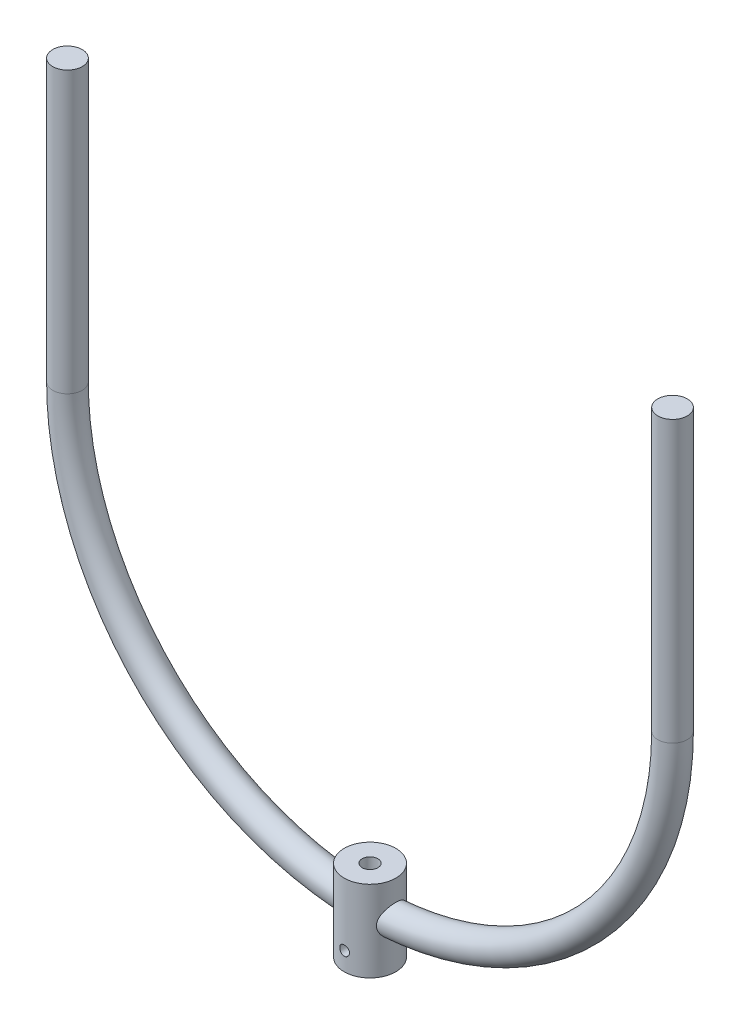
ISO-10303-21;
HEADER;
FILE_DESCRIPTION(('STEP AP214'),'2;1');
FILE_NAME('part.step','',(''),(''),'','','');
FILE_SCHEMA(('AUTOMOTIVE_DESIGN { 1 0 10303 214 1 1 1 1 }'));
ENDSEC;
DATA;
#1=APPLICATION_CONTEXT('core data for automotive mechanical design processes');
#2=APPLICATION_PROTOCOL_DEFINITION('international standard','automotive_design',2000,#1);
#3=PRODUCT_CONTEXT('',#1,'mechanical');
#4=PRODUCT('Part','Part','',(#3));
#5=PRODUCT_RELATED_PRODUCT_CATEGORY('part','',(#4));
#6=PRODUCT_DEFINITION_FORMATION('','',#4);
#7=PRODUCT_DEFINITION_CONTEXT('part definition',#1,'design');
#8=PRODUCT_DEFINITION('design','',#6,#7);
#9=PRODUCT_DEFINITION_SHAPE('','',#8);
#10=(LENGTH_UNIT() NAMED_UNIT(*) SI_UNIT(.MILLI.,.METRE.));
#11=(NAMED_UNIT(*) PLANE_ANGLE_UNIT() SI_UNIT($,.RADIAN.));
#12=(NAMED_UNIT(*) SI_UNIT($,.STERADIAN.) SOLID_ANGLE_UNIT());
#13=UNCERTAINTY_MEASURE_WITH_UNIT(LENGTH_MEASURE(1.E-05),#10,'distance_accuracy_value','');
#14=(GEOMETRIC_REPRESENTATION_CONTEXT(3) GLOBAL_UNCERTAINTY_ASSIGNED_CONTEXT((#13)) GLOBAL_UNIT_ASSIGNED_CONTEXT((#10,
#11,#12)) REPRESENTATION_CONTEXT('',''));
#15=CARTESIAN_POINT('',(0.,0.,0.));
#16=DIRECTION('',(0.,0.,1.));
#17=DIRECTION('',(1.,0.,0.));
#18=AXIS2_PLACEMENT_3D('',#15,#16,#17);
#19=CARTESIAN_POINT('',(0.,-228.6,0.));
#20=DIRECTION('',(0.,1.,0.));
#21=DIRECTION('',(0.,0.,1.));
#22=AXIS2_PLACEMENT_3D('',#19,#20,#21);
#23=CYLINDRICAL_SURFACE('',#22,6.74623999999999);
#24=CARTESIAN_POINT('',(0.,-228.6,0.));
#25=DIRECTION('',(0.,1.,0.));
#26=DIRECTION('',(0.,0.,1.));
#27=AXIS2_PLACEMENT_3D('',#24,#25,#26);
#28=CIRCLE('',#27,6.74623999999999);
#29=CARTESIAN_POINT('',(0.,-228.6,6.74623999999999));
#30=VERTEX_POINT('',#29);
#31=EDGE_CURVE('E98',#30,#30,#28,.T.);
#32=ORIENTED_EDGE('',*,*,#31,.T.);
#33=EDGE_LOOP('',(#32));
#34=FACE_BOUND('',#33,.T.);
#35=CARTESIAN_POINT('',(0.,-254.254,0.));
#36=DIRECTION('',(0.,-1.,0.));
#37=DIRECTION('',(0.,0.,-1.));
#38=AXIS2_PLACEMENT_3D('',#35,#36,#37);
#39=CIRCLE('',#38,6.74623999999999);
#40=CARTESIAN_POINT('',(0.,-254.254,-6.74623999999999));
#41=VERTEX_POINT('',#40);
#42=EDGE_CURVE('E35',#41,#41,#39,.F.);
#43=ORIENTED_EDGE('',*,*,#42,.F.);
#44=EDGE_LOOP('',(#43));
#45=FACE_BOUND('',#44,.T.);
#46=ADVANCED_FACE('F30',(#34,#45),#23,.F.);
#47=CARTESIAN_POINT('',(0.,0.,0.));
#48=DIRECTION('',(0.,0.,-1.));
#49=DIRECTION('',(-1.,0.,0.));
#50=AXIS2_PLACEMENT_3D('',#47,#48,#49);
#51=TOROIDAL_SURFACE('',#50,260.35,12.7);
#52=CARTESIAN_POINT('',(-260.35,0.,0.));
#53=DIRECTION('',(0.,-1.,0.));
#54=DIRECTION('',(1.,0.,0.));
#55=AXIS2_PLACEMENT_3D('',#52,#53,#54);
#56=CIRCLE('',#55,12.7);
#57=CARTESIAN_POINT('',(-260.35,0.,-12.7));
#58=VERTEX_POINT('',#57);
#59=EDGE_CURVE('E39',#58,#58,#56,.F.);
#60=ORIENTED_EDGE('',*,*,#59,.F.);
#61=EDGE_LOOP('',(#60));
#62=FACE_BOUND('',#61,.T.);
#63=CARTESIAN_POINT('',(-20.4249747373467,-268.768442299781,-8.76190801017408));
#64=CARTESIAN_POINT('',(-20.5326126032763,-269.000091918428,-8.5109895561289));
#65=CARTESIAN_POINT('',(-20.6390318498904,-269.221623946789,-8.25013660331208));
#66=CARTESIAN_POINT('',(-20.8469298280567,-269.643399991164,-7.70973443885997));
#67=CARTESIAN_POINT('',(-20.9484064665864,-269.843635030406,-7.43017742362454));
#68=CARTESIAN_POINT('',(-21.1441788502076,-270.221915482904,-6.85326619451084));
#69=CARTESIAN_POINT('',(-21.2384617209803,-270.399921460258,-6.5558816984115));
#70=CARTESIAN_POINT('',(-21.4173933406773,-270.732082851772,-5.94533940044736));
#71=CARTESIAN_POINT('',(-21.5020432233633,-270.886241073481,-5.63218346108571));
#72=CARTESIAN_POINT('',(-21.6599324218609,-271.169981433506,-4.9907332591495));
#73=CARTESIAN_POINT('',(-21.7331301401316,-271.299474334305,-4.66238917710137));
#74=CARTESIAN_POINT('',(-21.8658825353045,-271.531971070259,-3.99374123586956));
#75=CARTESIAN_POINT('',(-21.9254367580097,-271.634974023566,-3.65343697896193));
#76=CARTESIAN_POINT('',(-22.0292663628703,-271.813287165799,-2.96370543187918));
#77=CARTESIAN_POINT('',(-22.0735562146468,-271.888623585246,-2.61428712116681));
#78=CARTESIAN_POINT('',(-22.1457131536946,-272.01083871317,-1.90884415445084));
#79=CARTESIAN_POINT('',(-22.1735815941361,-272.057719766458,-1.55282004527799));
#80=CARTESIAN_POINT('',(-22.2107609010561,-272.120162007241,-0.862396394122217));
#81=CARTESIAN_POINT('',(-22.2212387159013,-272.137693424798,-0.528236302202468));
#82=CARTESIAN_POINT('',(-22.2270708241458,-272.147458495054,0.140577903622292));
#83=CARTESIAN_POINT('',(-22.2224258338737,-272.139693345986,0.475231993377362));
#84=CARTESIAN_POINT('',(-22.1981284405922,-272.098955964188,1.14243853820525));
#85=CARTESIAN_POINT('',(-22.178476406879,-272.065984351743,1.47499104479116));
#86=CARTESIAN_POINT('',(-22.1246490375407,-271.975203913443,2.13549034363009));
#87=CARTESIAN_POINT('',(-22.0904737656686,-271.917395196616,2.46343715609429));
#88=CARTESIAN_POINT('',(-22.0099545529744,-271.780164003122,3.10027278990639));
#89=CARTESIAN_POINT('',(-21.9641110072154,-271.701626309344,3.40941658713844));
#90=CARTESIAN_POINT('',(-21.8607252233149,-271.522823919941,4.01932687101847));
#91=CARTESIAN_POINT('',(-21.8031833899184,-271.422559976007,4.32009364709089));
#92=CARTESIAN_POINT('',(-21.6776025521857,-271.201127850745,4.91157759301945));
#93=CARTESIAN_POINT('',(-21.609562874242,-271.079958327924,5.20229411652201));
#94=CARTESIAN_POINT('',(-21.4643649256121,-270.817608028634,5.77218736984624));
#95=CARTESIAN_POINT('',(-21.3872061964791,-270.676426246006,6.05136351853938));
#96=CARTESIAN_POINT('',(-21.2200681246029,-270.365248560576,6.61445700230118));
#97=CARTESIAN_POINT('',(-21.1295832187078,-270.193982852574,6.89752268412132));
#98=CARTESIAN_POINT('',(-20.9419562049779,-269.830870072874,7.44779259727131));
#99=CARTESIAN_POINT('',(-20.8448138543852,-269.639022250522,7.71499624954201));
#100=CARTESIAN_POINT('',(-20.6458727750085,-269.235585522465,8.23258736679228));
#101=CARTESIAN_POINT('',(-20.5440703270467,-269.02398070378,8.48296099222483));
#102=CARTESIAN_POINT('',(-20.3380812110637,-268.582094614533,8.96559727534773));
#103=CARTESIAN_POINT('',(-20.2338944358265,-268.351812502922,9.19785911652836));
#104=CARTESIAN_POINT('',(-20.0157582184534,-267.851194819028,9.66396691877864));
#105=CARTESIAN_POINT('',(-19.9018016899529,-267.579125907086,9.89595253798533));
#106=CARTESIAN_POINT('',(-19.6770009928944,-267.014817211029,10.3357275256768));
#107=CARTESIAN_POINT('',(-19.566157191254,-266.722575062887,10.5435140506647));
#108=CARTESIAN_POINT('',(-19.3510572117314,-266.119349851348,10.9332855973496));
#109=CARTESIAN_POINT('',(-19.2467966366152,-265.808379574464,11.115287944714));
#110=CARTESIAN_POINT('',(-19.0483387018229,-265.168989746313,11.4520581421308));
#111=CARTESIAN_POINT('',(-18.9541390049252,-264.840574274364,11.6068323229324));
#112=CARTESIAN_POINT('',(-18.7950254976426,-264.228359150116,11.8623805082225));
#113=CARTESIAN_POINT('',(-18.7278877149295,-263.947095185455,11.967861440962));
#114=CARTESIAN_POINT('',(-18.6047182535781,-263.37539981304,12.1584526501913));
#115=CARTESIAN_POINT('',(-18.5486845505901,-263.08497008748,12.2435666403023));
#116=CARTESIAN_POINT('',(-18.4494924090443,-262.496844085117,12.3925329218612));
#117=CARTESIAN_POINT('',(-18.4063215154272,-262.199155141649,12.4564057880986));
#118=CARTESIAN_POINT('',(-18.3341838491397,-261.59820557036,12.5623424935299));
#119=CARTESIAN_POINT('',(-18.3052171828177,-261.29494490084,12.6044061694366));
#120=CARTESIAN_POINT('',(-18.2623728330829,-260.684282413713,12.6664042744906));
#121=CARTESIAN_POINT('',(-18.2485356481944,-260.376871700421,12.6862793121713));
#122=CARTESIAN_POINT('',(-18.2364641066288,-259.761116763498,12.7036260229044));
#123=CARTESIAN_POINT('',(-18.2382297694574,-259.4527725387,12.7010976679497));
#124=CARTESIAN_POINT('',(-18.2571327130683,-258.837415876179,12.6739100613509));
#125=CARTESIAN_POINT('',(-18.2742766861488,-258.530404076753,12.6492411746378));
#126=CARTESIAN_POINT('',(-18.3231441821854,-257.920071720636,12.5783485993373));
#127=CARTESIAN_POINT('',(-18.3548678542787,-257.616751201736,12.5321246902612));
#128=CARTESIAN_POINT('',(-18.43042670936,-257.025216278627,12.4207230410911));
#129=CARTESIAN_POINT('',(-18.4738490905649,-256.736826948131,12.3561879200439));
#130=CARTESIAN_POINT('',(-18.5717808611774,-256.166704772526,12.2084981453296));
#131=CARTESIAN_POINT('',(-18.6262938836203,-255.884974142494,12.1253373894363));
#132=CARTESIAN_POINT('',(-18.7448284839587,-255.329411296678,11.9412725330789));
#133=CARTESIAN_POINT('',(-18.8088505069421,-255.055579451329,11.8403676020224));
#134=CARTESIAN_POINT('',(-18.9447427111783,-254.516830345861,11.6217017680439));
#135=CARTESIAN_POINT('',(-19.016613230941,-254.251913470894,11.5039401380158));
#136=CARTESIAN_POINT('',(-19.2650694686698,-253.390097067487,11.087029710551));
#137=CARTESIAN_POINT('',(-19.455349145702,-252.813556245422,10.7525765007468));
#138=CARTESIAN_POINT('',(-19.751268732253,-251.993455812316,10.1922957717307));
#139=CARTESIAN_POINT('',(-19.8517516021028,-251.727326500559,9.99556985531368));
#140=CARTESIAN_POINT('',(-20.054117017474,-251.210639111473,9.58309582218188));
#141=CARTESIAN_POINT('',(-20.155999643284,-250.960081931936,9.36734661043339));
#142=CARTESIAN_POINT('',(-20.3756312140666,-250.435963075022,8.88069535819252));
#143=CARTESIAN_POINT('',(-20.4932461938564,-250.165353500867,8.60654732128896));
#144=CARTESIAN_POINT('',(-20.7242356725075,-249.648476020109,8.03441685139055));
#145=CARTESIAN_POINT('',(-20.8376094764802,-249.402212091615,7.73643053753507));
#146=CARTESIAN_POINT('',(-21.056853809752,-248.936406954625,7.11807874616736));
#147=CARTESIAN_POINT('',(-21.162730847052,-248.71684244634,6.79773317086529));
#148=CARTESIAN_POINT('',(-21.3639959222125,-248.306655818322,6.13594420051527));
#149=CARTESIAN_POINT('',(-21.4593869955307,-248.11602531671,5.79450695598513));
#150=CARTESIAN_POINT('',(-21.6183245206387,-247.802612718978,5.16536904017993));
#151=CARTESIAN_POINT('',(-21.6843721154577,-247.673959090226,4.88121260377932));
#152=CARTESIAN_POINT('',(-21.8066308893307,-247.437829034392,4.30220493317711));
#153=CARTESIAN_POINT('',(-21.8628439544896,-247.330348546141,4.00735576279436));
#154=CARTESIAN_POINT('',(-21.9641347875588,-247.137917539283,3.40873717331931));
#155=CARTESIAN_POINT('',(-22.0092200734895,-247.052951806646,3.10497393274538));
#156=CARTESIAN_POINT('',(-22.0872186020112,-246.906614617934,2.49025583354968));
#157=CARTESIAN_POINT('',(-22.1201316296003,-246.845243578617,2.17930084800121));
#158=CARTESIAN_POINT('',(-22.1730532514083,-246.746821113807,1.5511514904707));
#159=CARTESIAN_POINT('',(-22.1930084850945,-246.709870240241,1.23393679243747));
#160=CARTESIAN_POINT('',(-22.2192663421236,-246.661288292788,0.597004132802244));
#161=CARTESIAN_POINT('',(-22.225568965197,-246.649657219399,0.277286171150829));
#162=CARTESIAN_POINT('',(-22.224350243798,-246.651908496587,-0.362034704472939));
#163=CARTESIAN_POINT('',(-22.2168287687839,-246.665791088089,-0.681637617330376));
#164=CARTESIAN_POINT('',(-22.1881655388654,-246.718839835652,-1.31810750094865));
#165=CARTESIAN_POINT('',(-22.1670242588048,-246.758005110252,-1.63497456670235));
#166=CARTESIAN_POINT('',(-22.1134792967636,-246.857650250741,-2.24315848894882));
#167=CARTESIAN_POINT('',(-22.0818923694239,-246.916587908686,-2.53480247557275));
#168=CARTESIAN_POINT('',(-22.0080107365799,-247.055242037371,-3.11169591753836));
#169=CARTESIAN_POINT('',(-21.965716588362,-247.134957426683,-3.39694570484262));
#170=CARTESIAN_POINT('',(-21.8713218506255,-247.314201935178,-3.95945021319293));
#171=CARTESIAN_POINT('',(-21.8192216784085,-247.413730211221,-4.23670527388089));
#172=CARTESIAN_POINT('',(-21.7062373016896,-247.631567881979,-4.78199311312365));
#173=CARTESIAN_POINT('',(-21.6453496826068,-247.749884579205,-5.0500222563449));
#174=CARTESIAN_POINT('',(-21.5114084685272,-248.013074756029,-5.59408812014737));
#175=CARTESIAN_POINT('',(-21.4378011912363,-248.159228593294,-5.86936866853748));
#176=CARTESIAN_POINT('',(-21.2833037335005,-248.470440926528,-6.407018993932));
#177=CARTESIAN_POINT('',(-21.2024104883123,-248.635507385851,-6.66938326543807));
#178=CARTESIAN_POINT('',(-21.0348884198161,-248.983238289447,-7.18027669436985));
#179=CARTESIAN_POINT('',(-20.9482589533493,-249.165904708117,-7.42880429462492));
#180=CARTESIAN_POINT('',(-20.7708300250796,-249.547662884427,-7.91134286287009));
#181=CARTESIAN_POINT('',(-20.6800301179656,-249.746756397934,-8.14535227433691));
#182=CARTESIAN_POINT('',(-20.4811362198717,-250.19336526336,-8.63446912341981));
#183=CARTESIAN_POINT('',(-20.3725964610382,-250.443535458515,-8.88697621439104));
#184=CARTESIAN_POINT('',(-20.1546197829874,-250.963062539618,-9.37082331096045));
#185=CARTESIAN_POINT('',(-20.0451830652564,-251.232415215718,-9.60216793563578));
#186=CARTESIAN_POINT('',(-19.827842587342,-251.789576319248,-10.0432978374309));
#187=CARTESIAN_POINT('',(-19.7199415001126,-252.077413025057,-10.2530487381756));
#188=CARTESIAN_POINT('',(-19.5086196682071,-252.670039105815,-10.6496422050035));
#189=CARTESIAN_POINT('',(-19.4051990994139,-252.974829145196,-10.8364838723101));
#190=CARTESIAN_POINT('',(-19.1961102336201,-253.630528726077,-11.2030668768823));
#191=CARTESIAN_POINT('',(-19.0911924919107,-253.983047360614,-11.380372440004));
#192=CARTESIAN_POINT('',(-18.8943303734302,-254.705507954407,-11.7043097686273));
#193=CARTESIAN_POINT('',(-18.8023878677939,-255.075452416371,-11.8509371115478));
#194=CARTESIAN_POINT('',(-18.6358734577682,-255.829660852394,-12.1110972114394));
#195=CARTESIAN_POINT('',(-18.5612622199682,-256.213890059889,-12.2247050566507));
#196=CARTESIAN_POINT('',(-18.4331861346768,-256.99438125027,-12.4169931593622));
#197=CARTESIAN_POINT('',(-18.3797114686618,-257.390637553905,-12.4956896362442));
#198=CARTESIAN_POINT('',(-18.308289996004,-258.08393298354,-12.5999969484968));
#199=CARTESIAN_POINT('',(-18.2846639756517,-258.379126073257,-12.634180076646));
#200=CARTESIAN_POINT('',(-18.251453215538,-258.971933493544,-12.682111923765));
#201=CARTESIAN_POINT('',(-18.2418656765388,-259.269547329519,-12.6958647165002));
#202=CARTESIAN_POINT('',(-18.2372235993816,-259.864953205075,-12.7025317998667));
#203=CARTESIAN_POINT('',(-18.2421607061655,-260.162745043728,-12.6954580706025));
#204=CARTESIAN_POINT('',(-18.2665183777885,-260.756511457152,-12.6603864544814));
#205=CARTESIAN_POINT('',(-18.2859395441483,-261.052485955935,-12.6323876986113));
#206=CARTESIAN_POINT('',(-18.3386757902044,-261.640090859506,-12.5557057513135));
#207=CARTESIAN_POINT('',(-18.3719730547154,-261.931726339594,-12.5070490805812));
#208=CARTESIAN_POINT('',(-18.4514370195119,-262.509092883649,-12.3895163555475));
#209=CARTESIAN_POINT('',(-18.4976038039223,-262.794823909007,-12.3206401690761));
#210=CARTESIAN_POINT('',(-18.6014657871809,-263.358935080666,-12.1632634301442));
#211=CARTESIAN_POINT('',(-18.6591708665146,-263.637308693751,-12.0747460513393));
#212=CARTESIAN_POINT('',(-18.7844757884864,-264.185150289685,-11.8788721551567));
#213=CARTESIAN_POINT('',(-18.852079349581,-264.45461487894,-11.7715085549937));
#214=CARTESIAN_POINT('',(-18.9988191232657,-264.996001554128,-11.5332554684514));
#215=CARTESIAN_POINT('',(-19.0783511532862,-265.267429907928,-11.4014893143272));
#216=CARTESIAN_POINT('',(-19.2442919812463,-265.798244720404,-11.1191128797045));
#217=CARTESIAN_POINT('',(-19.3307037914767,-266.05762582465,-10.9684943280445));
#218=CARTESIAN_POINT('',(-19.5081875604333,-266.562981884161,-10.6496235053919));
#219=CARTESIAN_POINT('',(-19.5992517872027,-266.80897776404,-10.4814000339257));
#220=CARTESIAN_POINT('',(-19.7842082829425,-267.28731277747,-10.1279564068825));
#221=CARTESIAN_POINT('',(-19.8781005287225,-267.519652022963,-9.94273639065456));
#222=CARTESIAN_POINT('',(-20.0478801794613,-267.924784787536,-9.59493045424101));
#223=CARTESIAN_POINT('',(-20.123597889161,-268.100168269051,-9.43526588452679));
#224=CARTESIAN_POINT('',(-20.2747316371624,-268.441479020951,-9.10597116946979));
#225=CARTESIAN_POINT('',(-20.3501476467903,-268.607405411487,-8.93634009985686));
#226=CARTESIAN_POINT('',(-20.4249747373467,-268.768442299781,-8.76190801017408));
#227=B_SPLINE_CURVE_WITH_KNOTS('',3,(#63,#64,#65,#66,#67,#68,#69,#70,#71,#72,#73,#74,#75,#76,
#77,#78,#79,#80,#81,#82,#83,#84,#85,#86,#87,#88,#89,#90,#91,#92,#93,#94,#95,#96,#97,#98,#99,
#100,#101,#102,#103,#104,#105,#106,#107,#108,#109,#110,#111,#112,#113,#114,#115,#116,#117,#118,
#119,#120,#121,#122,#123,#124,#125,#126,#127,#128,#129,#130,#131,#132,#133,#134,#135,#136,#137,
#138,#139,#140,#141,#142,#143,#144,#145,#146,#147,#148,#149,#150,#151,#152,#153,#154,#155,#156,
#157,#158,#159,#160,#161,#162,#163,#164,#165,#166,#167,#168,#169,#170,#171,#172,#173,#174,#175,
#176,#177,#178,#179,#180,#181,#182,#183,#184,#185,#186,#187,#188,#189,#190,#191,#192,#193,#194,
#195,#196,#197,#198,#199,#200,#201,#202,#203,#204,#205,#206,#207,#208,#209,#210,#211,#212,#213,
#214,#215,#216,#217,#218,#219,#220,#221,#222,#223,#224,#225,#226),.UNSPECIFIED.,.T.,.F.,(4,2,2,
2,2,2,2,2,2,2,2,2,2,2,2,2,2,2,2,2,2,2,2,2,2,2,2,2,2,2,2,2,2,2,2,2,2,2,2,2,2,2,2,2,2,2,2,2,2,2,2,
2,2,2,2,2,2,2,2,2,2,2,2,2,2,2,2,2,2,2,2,2,2,2,2,2,2,2,2,2,2,4),(0.,1.07398139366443,
2.14841369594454,3.22472582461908,4.30091114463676,5.38091900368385,6.46096281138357,
7.53997997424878,8.61890821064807,9.62198195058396,10.6250081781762,11.6280097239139,
12.6310068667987,13.5966633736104,14.562286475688,15.5279715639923,16.4937052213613,
17.5216055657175,18.5495434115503,19.5783164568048,20.6071358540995,21.7316065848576,
22.8562093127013,23.9800527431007,25.1036345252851,26.0261081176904,26.9484133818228,
27.86982265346,28.791238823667,29.7151154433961,30.6389932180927,31.5632732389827,
32.4875627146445,33.3827494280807,34.2782298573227,35.173752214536,36.0693132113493,
38.1396205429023,39.1765996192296,40.2136384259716,41.4205034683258,42.6275653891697,
43.8335662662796,45.0392171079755,45.9947836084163,46.9501666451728,47.9049024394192,
48.8596550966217,49.8183149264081,50.7769747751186,51.7356436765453,52.694279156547,
53.590919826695,54.4875138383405,55.3840697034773,56.2809748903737,57.2407654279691,
58.2009615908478,59.1612655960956,60.1216723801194,61.2354830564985,62.3490500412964,
63.464363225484,64.5797201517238,65.8029846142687,67.0264253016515,68.2470616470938,
69.4671303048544,70.3604845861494,71.2536607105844,72.1463231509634,73.0390226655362,
73.9305795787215,74.8221423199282,75.7144718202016,76.6071373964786,77.5423002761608,
78.4778748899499,79.4119422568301,80.3460019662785,81.0925370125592,81.8391414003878),.UNSPECIFIED.);
#228=CARTESIAN_POINT('',(-20.4249747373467,-268.768442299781,-8.76190801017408));
#229=VERTEX_POINT('',#228);
#230=EDGE_CURVE('E51',#229,#229,#227,.T.);
#231=ORIENTED_EDGE('',*,*,#230,.T.);
#232=EDGE_LOOP('',(#231));
#233=FACE_BOUND('',#232,.T.);
#234=ADVANCED_FACE('F32',(#62,#233),#51,.T.);
#235=CARTESIAN_POINT('',(-260.35,241.3,0.));
#236=DIRECTION('',(0.,-1.,0.));
#237=DIRECTION('',(0.,0.,-1.));
#238=AXIS2_PLACEMENT_3D('',#235,#236,#237);
#239=CYLINDRICAL_SURFACE('',#238,12.7);
#240=CARTESIAN_POINT('',(-260.35,241.3,0.));
#241=DIRECTION('',(0.,1.,0.));
#242=DIRECTION('',(0.,0.,1.));
#243=AXIS2_PLACEMENT_3D('',#240,#241,#242);
#244=CIRCLE('',#243,12.7);
#245=CARTESIAN_POINT('',(-260.35,241.3,-12.7));
#246=VERTEX_POINT('',#245);
#247=EDGE_CURVE('E109',#246,#246,#244,.T.);
#248=CARTESIAN_POINT('',(-260.35,241.3,-12.7));
#249=CARTESIAN_POINT('',(-260.35,238.786458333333,-12.7));
#250=CARTESIAN_POINT('',(-260.35,236.272916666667,-12.7));
#251=CARTESIAN_POINT('',(-260.35,231.245833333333,-12.7));
#252=CARTESIAN_POINT('',(-260.35,228.732291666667,-12.7));
#253=CARTESIAN_POINT('',(-260.35,223.705208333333,-12.7));
#254=CARTESIAN_POINT('',(-260.35,221.191666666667,-12.7));
#255=CARTESIAN_POINT('',(-260.35,216.164583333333,-12.7));
#256=CARTESIAN_POINT('',(-260.35,213.651041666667,-12.7));
#257=CARTESIAN_POINT('',(-260.35,208.623958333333,-12.7));
#258=CARTESIAN_POINT('',(-260.35,206.110416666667,-12.7));
#259=CARTESIAN_POINT('',(-260.35,201.083333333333,-12.7));
#260=CARTESIAN_POINT('',(-260.35,198.569791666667,-12.7));
#261=CARTESIAN_POINT('',(-260.35,193.542708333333,-12.7));
#262=CARTESIAN_POINT('',(-260.35,191.029166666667,-12.7));
#263=CARTESIAN_POINT('',(-260.35,186.002083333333,-12.7));
#264=CARTESIAN_POINT('',(-260.35,183.488541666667,-12.7));
#265=CARTESIAN_POINT('',(-260.35,178.461458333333,-12.7));
#266=CARTESIAN_POINT('',(-260.35,175.947916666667,-12.7));
#267=CARTESIAN_POINT('',(-260.35,170.920833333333,-12.7));
#268=CARTESIAN_POINT('',(-260.35,168.407291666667,-12.7));
#269=CARTESIAN_POINT('',(-260.35,163.380208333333,-12.7));
#270=CARTESIAN_POINT('',(-260.35,160.866666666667,-12.7));
#271=CARTESIAN_POINT('',(-260.35,155.839583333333,-12.7));
#272=CARTESIAN_POINT('',(-260.35,153.326041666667,-12.7));
#273=CARTESIAN_POINT('',(-260.35,148.298958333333,-12.7));
#274=CARTESIAN_POINT('',(-260.35,145.785416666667,-12.7));
#275=CARTESIAN_POINT('',(-260.35,140.758333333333,-12.7));
#276=CARTESIAN_POINT('',(-260.35,138.244791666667,-12.7));
#277=CARTESIAN_POINT('',(-260.35,133.217708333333,-12.7));
#278=CARTESIAN_POINT('',(-260.35,130.704166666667,-12.7));
#279=CARTESIAN_POINT('',(-260.35,125.677083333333,-12.7));
#280=CARTESIAN_POINT('',(-260.35,123.163541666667,-12.7));
#281=CARTESIAN_POINT('',(-260.35,118.136458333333,-12.7));
#282=CARTESIAN_POINT('',(-260.35,115.622916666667,-12.7));
#283=CARTESIAN_POINT('',(-260.35,110.595833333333,-12.7));
#284=CARTESIAN_POINT('',(-260.35,108.082291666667,-12.7));
#285=CARTESIAN_POINT('',(-260.35,103.055208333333,-12.7));
#286=CARTESIAN_POINT('',(-260.35,100.541666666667,-12.7));
#287=CARTESIAN_POINT('',(-260.35,95.5145833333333,-12.7));
#288=CARTESIAN_POINT('',(-260.35,93.0010416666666,-12.7));
#289=CARTESIAN_POINT('',(-260.35,87.9739583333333,-12.7));
#290=CARTESIAN_POINT('',(-260.35,85.4604166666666,-12.7));
#291=CARTESIAN_POINT('',(-260.35,80.4333333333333,-12.7));
#292=CARTESIAN_POINT('',(-260.35,77.9197916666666,-12.7));
#293=CARTESIAN_POINT('',(-260.35,72.8927083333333,-12.7));
#294=CARTESIAN_POINT('',(-260.35,70.3791666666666,-12.7));
#295=CARTESIAN_POINT('',(-260.35,65.3520833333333,-12.7));
#296=CARTESIAN_POINT('',(-260.35,62.8385416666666,-12.7));
#297=CARTESIAN_POINT('',(-260.35,57.8114583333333,-12.7));
#298=CARTESIAN_POINT('',(-260.35,55.2979166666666,-12.7));
#299=CARTESIAN_POINT('',(-260.35,50.2708333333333,-12.7));
#300=CARTESIAN_POINT('',(-260.35,47.7572916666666,-12.7));
#301=CARTESIAN_POINT('',(-260.35,42.7302083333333,-12.7));
#302=CARTESIAN_POINT('',(-260.35,40.2166666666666,-12.7));
#303=CARTESIAN_POINT('',(-260.35,35.1895833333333,-12.7));
#304=CARTESIAN_POINT('',(-260.35,32.6760416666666,-12.7));
#305=CARTESIAN_POINT('',(-260.35,27.6489583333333,-12.7));
#306=CARTESIAN_POINT('',(-260.35,25.1354166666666,-12.7));
#307=CARTESIAN_POINT('',(-260.35,20.1083333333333,-12.7));
#308=CARTESIAN_POINT('',(-260.35,17.5947916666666,-12.7));
#309=CARTESIAN_POINT('',(-260.35,12.5677083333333,-12.7));
#310=CARTESIAN_POINT('',(-260.35,10.0541666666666,-12.7));
#311=CARTESIAN_POINT('',(-260.35,5.02708333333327,-12.7));
#312=CARTESIAN_POINT('',(-260.35,2.51354166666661,-12.7));
#313=CARTESIAN_POINT('',(-260.35,0.,-12.7));
#314=B_SPLINE_CURVE_WITH_KNOTS('',3,(#248,#249,#250,#251,#252,#253,#254,#255,#256,#257,#258,
#259,#260,#261,#262,#263,#264,#265,#266,#267,#268,#269,#270,#271,#272,#273,#274,#275,#276,#277,
#278,#279,#280,#281,#282,#283,#284,#285,#286,#287,#288,#289,#290,#291,#292,#293,#294,#295,#296,
#297,#298,#299,#300,#301,#302,#303,#304,#305,#306,#307,#308,#309,#310,#311,#312,#313),
.UNSPECIFIED.,.F.,.F.,(4,2,2,2,2,2,2,2,2,2,2,2,2,2,2,2,2,2,2,2,2,2,2,2,2,2,2,2,2,2,2,2,4),(0.,
7.540625,15.08125,22.621875,30.1625,37.703125,45.24375,52.784375,60.325,67.865625,75.40625,
82.946875,90.4875,98.028125,105.56875,113.109375,120.65,128.190625,135.73125,143.271875,
150.8125,158.353125,165.89375,173.434375,180.975,188.515625,196.05625,203.596875,211.1375,
218.678125,226.21875,233.759375,241.3),.UNSPECIFIED.);
#315=EDGE_CURVE('BSEAM131',#246,#58,#314,.T.);
#316=ORIENTED_EDGE('',*,*,#247,.F.);
#317=ORIENTED_EDGE('',*,*,#59,.T.);
#318=ORIENTED_EDGE('',*,*,#315,.T.);
#319=ORIENTED_EDGE('',*,*,#315,.F.);
#320=EDGE_LOOP('',(#316,#318,#317,#319));
#321=FACE_BOUND('',#320,.T.);
#322=ADVANCED_FACE('F131',(#321),#239,.T.);
#323=CARTESIAN_POINT('',(-260.35,241.3,0.));
#324=DIRECTION('',(0.,1.,0.));
#325=DIRECTION('',(0.,0.,1.));
#326=AXIS2_PLACEMENT_3D('',#323,#324,#325);
#327=PLANE('',#326);
#328=ORIENTED_EDGE('',*,*,#247,.T.);
#329=EDGE_LOOP('',(#328));
#330=FACE_BOUND('',#329,.T.);
#331=ADVANCED_FACE('F124',(#330),#327,.T.);
#332=CARTESIAN_POINT('',(0.,-228.6,0.));
#333=DIRECTION('',(0.,-1.,0.));
#334=DIRECTION('',(0.,0.,-1.));
#335=AXIS2_PLACEMENT_3D('',#332,#333,#334);
#336=CYLINDRICAL_SURFACE('',#335,22.225);
#337=CARTESIAN_POINT('',(4.2164,-282.575,21.8213793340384));
#338=CARTESIAN_POINT('',(4.21639105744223,-282.809539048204,21.8213838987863));
#339=CARTESIAN_POINT('',(4.19676409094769,-283.044193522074,21.8252016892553));
#340=CARTESIAN_POINT('',(4.11882988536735,-283.50688205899,21.8400407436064));
#341=CARTESIAN_POINT('',(4.06049015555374,-283.734910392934,21.8510680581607));
#342=CARTESIAN_POINT('',(3.90698964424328,-284.177585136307,21.8790333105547));
#343=CARTESIAN_POINT('',(3.81186356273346,-284.392243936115,21.8959656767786));
#344=CARTESIAN_POINT('',(3.58758308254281,-284.802543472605,21.9338265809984));
#345=CARTESIAN_POINT('',(3.45843120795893,-284.998185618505,21.9547548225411));
#346=CARTESIAN_POINT('',(3.16801172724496,-285.367404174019,21.9985471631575));
#347=CARTESIAN_POINT('',(3.00639429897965,-285.54070316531,22.0214306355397));
#348=CARTESIAN_POINT('',(2.65638744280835,-285.85789818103,22.0663840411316));
#349=CARTESIAN_POINT('',(2.46799623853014,-286.00179225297,22.088453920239));
#350=CARTESIAN_POINT('',(2.06796481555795,-286.257158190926,22.1295012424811));
#351=CARTESIAN_POINT('',(1.85615455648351,-286.36836813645,22.1484531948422));
#352=CARTESIAN_POINT('',(1.41643682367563,-286.553521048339,22.1809123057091));
#353=CARTESIAN_POINT('',(1.18853070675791,-286.62746715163,22.1944199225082));
#354=CARTESIAN_POINT('',(0.725966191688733,-286.735134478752,22.214331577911));
#355=CARTESIAN_POINT('',(0.491420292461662,-286.769323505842,22.2208181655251));
#356=CARTESIAN_POINT('',(0.0198378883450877,-286.797964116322,22.226241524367));
#357=CARTESIAN_POINT('',(-0.217198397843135,-286.79241916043,22.2251789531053));
#358=CARTESIAN_POINT('',(-0.683823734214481,-286.742107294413,22.2156881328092));
#359=CARTESIAN_POINT('',(-0.913469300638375,-286.697844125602,22.2073544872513));
#360=CARTESIAN_POINT('',(-1.36201325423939,-286.572149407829,22.1843641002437));
#361=CARTESIAN_POINT('',(-1.58091124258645,-286.490716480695,22.1697071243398));
#362=CARTESIAN_POINT('',(-2.003203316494,-286.292516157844,22.1355592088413));
#363=CARTESIAN_POINT('',(-2.20650091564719,-286.175548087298,22.1160409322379));
#364=CARTESIAN_POINT('',(-2.59077073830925,-285.909745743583,22.0743277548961));
#365=CARTESIAN_POINT('',(-2.77174063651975,-285.760908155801,22.0521325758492));
#366=CARTESIAN_POINT('',(-3.10920346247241,-285.432817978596,22.0071116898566));
#367=CARTESIAN_POINT('',(-3.26526760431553,-285.253124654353,21.9842815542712));
#368=CARTESIAN_POINT('',(-3.5451097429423,-284.869890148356,21.9408964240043));
#369=CARTESIAN_POINT('',(-3.66888724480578,-284.666348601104,21.9203414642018));
#370=CARTESIAN_POINT('',(-3.88076918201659,-284.240618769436,21.8838271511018));
#371=CARTESIAN_POINT('',(-3.96881007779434,-284.018398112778,21.8678759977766));
#372=CARTESIAN_POINT('',(-4.10618435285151,-283.561947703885,21.8424999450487));
#373=CARTESIAN_POINT('',(-4.15552223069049,-283.327719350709,21.8330742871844));
#374=CARTESIAN_POINT('',(-4.21346134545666,-282.857772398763,21.8219668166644));
#375=CARTESIAN_POINT('',(-4.22267916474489,-282.622132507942,21.8201678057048));
#376=CARTESIAN_POINT('',(-4.20177042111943,-282.152680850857,21.8242035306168));
#377=CARTESIAN_POINT('',(-4.1716458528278,-281.918868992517,21.8300378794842));
#378=CARTESIAN_POINT('',(-4.07343717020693,-281.461745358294,21.8485736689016));
#379=CARTESIAN_POINT('',(-4.00567736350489,-281.23836131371,21.8612164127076));
#380=CARTESIAN_POINT('',(-3.83446622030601,-280.806117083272,21.8918937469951));
#381=CARTESIAN_POINT('',(-3.73101219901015,-280.597257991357,21.90992874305));
#382=CARTESIAN_POINT('',(-3.48993424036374,-280.197279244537,21.9496247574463));
#383=CARTESIAN_POINT('',(-3.35192143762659,-280.006398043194,21.971326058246));
#384=CARTESIAN_POINT('',(-3.04616691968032,-279.650280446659,22.0157966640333));
#385=CARTESIAN_POINT('',(-2.87842246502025,-279.48504641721,22.0385660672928));
#386=CARTESIAN_POINT('',(-2.51521000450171,-279.182604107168,22.082984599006));
#387=CARTESIAN_POINT('',(-2.31939360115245,-279.045810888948,22.104614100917));
#388=CARTESIAN_POINT('',(-1.90720047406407,-278.807065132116,22.1439836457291));
#389=CARTESIAN_POINT('',(-1.69082455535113,-278.705111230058,22.1617238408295));
#390=CARTESIAN_POINT('',(-1.24479168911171,-278.53955672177,22.19123163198));
#391=CARTESIAN_POINT('',(-1.0152120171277,-278.475753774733,22.2030306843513));
#392=CARTESIAN_POINT('',(-0.548349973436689,-278.387667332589,22.2194610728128));
#393=CARTESIAN_POINT('',(-0.311068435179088,-278.363379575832,22.2240931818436));
#394=CARTESIAN_POINT('',(0.160484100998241,-278.35516421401,22.2256518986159));
#395=CARTESIAN_POINT('',(0.394744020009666,-278.370610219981,22.2226980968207));
#396=CARTESIAN_POINT('',(0.85726621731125,-278.440050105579,22.2096659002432));
#397=CARTESIAN_POINT('',(1.08552855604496,-278.494043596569,22.1995875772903));
#398=CARTESIAN_POINT('',(1.52923473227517,-278.638779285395,22.1734392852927));
#399=CARTESIAN_POINT('',(1.74470150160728,-278.729453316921,22.1573804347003));
#400=CARTESIAN_POINT('',(2.15745542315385,-278.944900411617,22.1210078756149));
#401=CARTESIAN_POINT('',(2.3547413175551,-279.069675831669,22.1006938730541));
#402=CARTESIAN_POINT('',(2.7286504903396,-279.351932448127,22.0576760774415));
#403=CARTESIAN_POINT('',(2.90492923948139,-279.509865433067,22.0349416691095));
#404=CARTESIAN_POINT('',(3.22869928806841,-279.853018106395,21.9898365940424));
#405=CARTESIAN_POINT('',(3.37618380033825,-280.038244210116,21.9674660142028));
#406=CARTESIAN_POINT('',(3.63949923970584,-280.432833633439,21.92538869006));
#407=CARTESIAN_POINT('',(3.75501581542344,-280.642409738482,21.9057093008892));
#408=CARTESIAN_POINT('',(3.94901550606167,-281.078302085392,21.8715724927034));
#409=CARTESIAN_POINT('',(4.02753334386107,-281.304602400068,21.8571101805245));
#410=CARTESIAN_POINT('',(4.12947510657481,-281.705453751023,21.8380384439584));
#411=CARTESIAN_POINT('',(4.16201565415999,-281.87766803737,21.8318286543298));
#412=CARTESIAN_POINT('',(4.20548113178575,-282.224900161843,21.8234974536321));
#413=CARTESIAN_POINT('',(4.21640667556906,-282.399917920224,21.8213759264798));
#414=CARTESIAN_POINT('',(4.2164,-282.575,21.8213793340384));
#415=B_SPLINE_CURVE_WITH_KNOTS('',3,(#337,#338,#339,#340,#341,#342,#343,#344,#345,#346,#347,
#348,#349,#350,#351,#352,#353,#354,#355,#356,#357,#358,#359,#360,#361,#362,#363,#364,#365,#366,
#367,#368,#369,#370,#371,#372,#373,#374,#375,#376,#377,#378,#379,#380,#381,#382,#383,#384,#385,
#386,#387,#388,#389,#390,#391,#392,#393,#394,#395,#396,#397,#398,#399,#400,#401,#402,#403,#404,
#405,#406,#407,#408,#409,#410,#411,#412,#413,#414),.UNSPECIFIED.,.T.,.F.,(4,2,2,2,2,2,2,2,2,2,2,
2,2,2,2,2,2,2,2,2,2,2,2,2,2,2,2,2,2,2,2,2,2,2,2,2,2,2,4),(0.,0.702976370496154,1.40654348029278,
2.10944853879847,2.81230146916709,3.52317866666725,4.23410305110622,4.95057823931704,
5.66699310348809,6.37489010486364,7.08272545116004,7.78148626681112,8.48027299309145,
9.18308168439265,9.88596350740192,10.5998780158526,11.3138034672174,12.0289927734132,
12.744098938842,13.4481753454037,14.1522160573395,14.8502820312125,15.5484005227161,
16.2547582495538,16.9611810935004,17.677284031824,18.3933589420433,19.1056015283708,
19.8177672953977,20.5187750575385,21.2197757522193,21.9194796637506,22.6192319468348,
23.329221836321,24.0393788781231,24.7562892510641,25.47252546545,25.9973082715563,
26.5220761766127),.UNSPECIFIED.);
#416=CARTESIAN_POINT('',(4.2164,-282.575,21.8213793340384));
#417=VERTEX_POINT('',#416);
#418=EDGE_CURVE('E10',#417,#417,#415,.T.);
#419=ORIENTED_EDGE('',*,*,#418,.T.);
#420=EDGE_LOOP('',(#419));
#421=FACE_BOUND('',#420,.T.);
#422=ORIENTED_EDGE('',*,*,#230,.F.);
#423=EDGE_LOOP('',(#422));
#424=FACE_BOUND('',#423,.T.);
#425=CARTESIAN_POINT('',(20.4249747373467,-268.768442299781,-8.76190801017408));
#426=CARTESIAN_POINT('',(20.3172449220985,-268.536597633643,-9.01303548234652));
#427=CARTESIAN_POINT('',(20.2082490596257,-268.294518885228,-9.25431565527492));
#428=CARTESIAN_POINT('',(19.9903990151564,-267.790930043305,-9.71595564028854));
#429=CARTESIAN_POINT('',(19.8815449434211,-267.529409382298,-9.93630392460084));
#430=CARTESIAN_POINT('',(19.6665374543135,-266.987242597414,-10.355361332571));
#431=CARTESIAN_POINT('',(19.5603917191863,-266.706548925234,-10.554013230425));
#432=CARTESIAN_POINT('',(19.4057192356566,-266.272571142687,-10.8342089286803));
#433=CARTESIAN_POINT('',(19.3549215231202,-266.12576228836,-10.9246402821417));
#434=CARTESIAN_POINT('',(19.2551981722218,-265.827900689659,-11.0994637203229));
#435=CARTESIAN_POINT('',(19.2062731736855,-265.676846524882,-11.1838537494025));
#436=CARTESIAN_POINT('',(19.062406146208,-265.215968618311,-11.4285269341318));
#437=CARTESIAN_POINT('',(18.9709175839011,-264.899939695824,-11.5793359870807));
#438=CARTESIAN_POINT('',(18.8004211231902,-264.253268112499,-11.8541544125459));
#439=CARTESIAN_POINT('',(18.721411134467,-263.922627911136,-11.9781682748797));
#440=CARTESIAN_POINT('',(18.5790879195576,-263.249446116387,-12.1977550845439));
#441=CARTESIAN_POINT('',(18.5157443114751,-262.906929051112,-12.2933831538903));
#442=CARTESIAN_POINT('',(18.4072946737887,-262.212194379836,-12.455186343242));
#443=CARTESIAN_POINT('',(18.3621854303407,-261.85997849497,-12.5213666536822));
#444=CARTESIAN_POINT('',(18.2960133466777,-261.187758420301,-12.6178261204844));
#445=CARTESIAN_POINT('',(18.2728736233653,-260.86840218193,-12.6512197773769));
#446=CARTESIAN_POINT('',(18.2434715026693,-260.22731083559,-12.6935832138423));
#447=CARTESIAN_POINT('',(18.2372078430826,-259.905575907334,-12.7025548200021));
#448=CARTESIAN_POINT('',(18.2416354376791,-259.262420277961,-12.6961950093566));
#449=CARTESIAN_POINT('',(18.2523298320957,-258.940999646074,-12.6808590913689));
#450=CARTESIAN_POINT('',(18.2900479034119,-258.30116487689,-12.6263953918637));
#451=CARTESIAN_POINT('',(18.3170715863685,-257.982750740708,-12.5872676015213));
#452=CARTESIAN_POINT('',(18.3835326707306,-257.375721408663,-12.4899765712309));
#453=CARTESIAN_POINT('',(18.4218487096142,-257.086705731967,-12.4335190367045));
#454=CARTESIAN_POINT('',(18.510032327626,-256.514699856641,-12.3018536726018));
#455=CARTESIAN_POINT('',(18.5599035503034,-256.231711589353,-12.2266399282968));
#456=CARTESIAN_POINT('',(18.6696962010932,-255.673106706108,-12.0583225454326));
#457=CARTESIAN_POINT('',(18.7296177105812,-255.397490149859,-11.96521876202));
#458=CARTESIAN_POINT('',(18.8578949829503,-254.854706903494,-11.7620101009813));
#459=CARTESIAN_POINT('',(18.9262510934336,-254.587540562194,-11.6519045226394));
#460=CARTESIAN_POINT('',(19.1619091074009,-253.725505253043,-11.263718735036));
#461=CARTESIAN_POINT('',(19.3437406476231,-253.149493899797,-10.9512172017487));
#462=CARTESIAN_POINT('',(19.629271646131,-252.327539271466,-10.4250827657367));
#463=CARTESIAN_POINT('',(19.7266663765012,-252.060358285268,-10.2399614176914));
#464=CARTESIAN_POINT('',(19.9236913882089,-251.540604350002,-9.85112190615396));
#465=CARTESIAN_POINT('',(20.0233218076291,-251.288032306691,-9.64740259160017));
#466=CARTESIAN_POINT('',(20.2402546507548,-250.755512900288,-9.18471394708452));
#467=CARTESIAN_POINT('',(20.3575885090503,-250.478545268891,-8.92232412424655));
#468=CARTESIAN_POINT('',(20.5893093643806,-249.947794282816,-8.37374637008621));
#469=CARTESIAN_POINT('',(20.7036958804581,-249.694014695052,-8.08755458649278));
#470=CARTESIAN_POINT('',(20.926340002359,-249.211793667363,-7.49264478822));
#471=CARTESIAN_POINT('',(21.0346015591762,-248.983335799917,-7.18394159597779));
#472=CARTESIAN_POINT('',(21.2420366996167,-248.553856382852,-6.54516462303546));
#473=CARTESIAN_POINT('',(21.341212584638,-248.352827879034,-6.21509629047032));
#474=CARTESIAN_POINT('',(21.5100327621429,-248.015668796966,-5.59920183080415));
#475=CARTESIAN_POINT('',(21.5817243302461,-247.874441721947,-5.31671783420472));
#476=CARTESIAN_POINT('',(21.7156769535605,-247.613129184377,-4.73999843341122));
#477=CARTESIAN_POINT('',(21.7779397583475,-247.493039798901,-4.44576522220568));
#478=CARTESIAN_POINT('',(21.8916010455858,-247.27545953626,-3.84722615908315));
#479=CARTESIAN_POINT('',(21.9430067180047,-247.177953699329,-3.54292712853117));
#480=CARTESIAN_POINT('',(22.0337657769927,-247.006739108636,-2.92591982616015));
#481=CARTESIAN_POINT('',(22.0731190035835,-246.933030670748,-2.6132114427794));
#482=CARTESIAN_POINT('',(22.138919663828,-246.810216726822,-1.9800596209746));
#483=CARTESIAN_POINT('',(22.1653038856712,-246.761231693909,-1.65958613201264));
#484=CARTESIAN_POINT('',(22.2041640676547,-246.689200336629,-1.01488830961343));
#485=CARTESIAN_POINT('',(22.2166400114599,-246.666154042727,-0.690663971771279));
#486=CARTESIAN_POINT('',(22.2273343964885,-246.646394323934,-0.0412095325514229));
#487=CARTESIAN_POINT('',(22.2255542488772,-246.649678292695,0.284020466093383));
#488=CARTESIAN_POINT('',(22.2077888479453,-246.682517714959,0.932746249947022));
#489=CARTESIAN_POINT('',(22.1918043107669,-246.712071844,1.25624212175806));
#490=CARTESIAN_POINT('',(22.1478726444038,-246.793616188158,1.87364231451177));
#491=CARTESIAN_POINT('',(22.1209605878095,-246.843667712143,2.16787975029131));
#492=CARTESIAN_POINT('',(22.0560724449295,-246.964966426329,2.75068227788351));
#493=CARTESIAN_POINT('',(22.0180970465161,-247.036212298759,3.03924772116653));
#494=CARTESIAN_POINT('',(21.9319058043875,-247.199012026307,3.60904148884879));
#495=CARTESIAN_POINT('',(21.8836887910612,-247.290568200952,3.89026897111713));
#496=CARTESIAN_POINT('',(21.7780104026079,-247.492945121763,4.44390906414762));
#497=CARTESIAN_POINT('',(21.7205485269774,-247.603766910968,4.71632119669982));
#498=CARTESIAN_POINT('',(21.594081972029,-247.850208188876,5.26593886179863));
#499=CARTESIAN_POINT('',(21.5246141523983,-247.986861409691,5.54257373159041));
#500=CARTESIAN_POINT('',(21.37799774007,-248.279113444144,6.08362052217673));
#501=CARTESIAN_POINT('',(21.3008465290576,-248.434718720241,6.34802823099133));
#502=CARTESIAN_POINT('',(21.1403319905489,-248.763591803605,6.86366605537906));
#503=CARTESIAN_POINT('',(21.0569679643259,-248.936861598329,7.11489468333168));
#504=CARTESIAN_POINT('',(20.8855289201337,-249.299876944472,7.60344269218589));
#505=CARTESIAN_POINT('',(20.7974536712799,-249.48962330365,7.84076139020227));
#506=CARTESIAN_POINT('',(20.6040941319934,-249.915399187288,8.33687204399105));
#507=CARTESIAN_POINT('',(20.4982708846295,-250.154028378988,8.59322691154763));
#508=CARTESIAN_POINT('',(20.2847777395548,-250.650406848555,9.08572794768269));
#509=CARTESIAN_POINT('',(20.1771081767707,-250.908152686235,9.32187773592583));
#510=CARTESIAN_POINT('',(19.9622015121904,-251.44199056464,9.77362743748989));
#511=CARTESIAN_POINT('',(19.854965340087,-251.718110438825,9.98919491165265));
#512=CARTESIAN_POINT('',(19.6436829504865,-252.287232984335,10.3985289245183));
#513=CARTESIAN_POINT('',(19.5396368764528,-252.580236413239,10.5922944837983));
#514=CARTESIAN_POINT('',(19.3260351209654,-253.216091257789,10.9776520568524));
#515=CARTESIAN_POINT('',(19.2171843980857,-253.560835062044,11.1665268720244));
#516=CARTESIAN_POINT('',(19.0107776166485,-254.268428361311,11.5144215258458));
#517=CARTESIAN_POINT('',(18.9132233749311,-254.631280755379,11.6734365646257));
#518=CARTESIAN_POINT('',(18.733763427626,-255.372345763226,11.9593136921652));
#519=CARTESIAN_POINT('',(18.6518264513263,-255.750525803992,12.0862402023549));
#520=CARTESIAN_POINT('',(18.5074985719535,-256.520216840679,12.3061164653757));
#521=CARTESIAN_POINT('',(18.4450989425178,-256.911721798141,12.3990813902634));
#522=CARTESIAN_POINT('',(18.3568701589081,-257.600089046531,12.5291792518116));
#523=CARTESIAN_POINT('',(18.3257382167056,-257.894736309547,12.5745673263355));
#524=CARTESIAN_POINT('',(18.2772040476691,-258.487552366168,12.645010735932));
#525=CARTESIAN_POINT('',(18.2597989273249,-258.785720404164,12.6700703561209));
#526=CARTESIAN_POINT('',(18.2394822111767,-259.383378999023,12.6993004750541));
#527=CARTESIAN_POINT('',(18.2365609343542,-259.682868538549,12.7034849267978));
#528=CARTESIAN_POINT('',(18.2454431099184,-260.281194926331,12.6907246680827));
#529=CARTESIAN_POINT('',(18.2572470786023,-260.580031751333,12.6737792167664));
#530=CARTESIAN_POINT('',(18.2952966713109,-261.174812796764,12.618789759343));
#531=CARTESIAN_POINT('',(18.3215417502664,-261.47075712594,12.5807465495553));
#532=CARTESIAN_POINT('',(18.3876705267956,-262.05766752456,12.4838945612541));
#533=CARTESIAN_POINT('',(18.4275542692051,-262.348633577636,12.4250857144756));
#534=CARTESIAN_POINT('',(18.5197454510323,-262.923849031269,12.2872501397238));
#535=CARTESIAN_POINT('',(18.5720585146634,-263.208095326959,12.2082142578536));
#536=CARTESIAN_POINT('',(18.6875692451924,-263.768261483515,12.0306520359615));
#537=CARTESIAN_POINT('',(18.7507711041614,-264.044178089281,11.9321181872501));
#538=CARTESIAN_POINT('',(18.8879293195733,-264.592785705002,11.7138273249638));
#539=CARTESIAN_POINT('',(18.9621070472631,-264.865241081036,11.5936184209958));
#540=CARTESIAN_POINT('',(19.1181084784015,-265.39896763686,11.3345233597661));
#541=CARTESIAN_POINT('',(19.1999353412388,-265.660234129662,11.1956294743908));
#542=CARTESIAN_POINT('',(19.3692523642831,-266.170610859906,10.9000773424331));
#543=CARTESIAN_POINT('',(19.4567429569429,-266.419720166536,10.7434177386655));
#544=CARTESIAN_POINT('',(19.6354723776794,-266.905048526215,10.4131698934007));
#545=CARTESIAN_POINT('',(19.7267115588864,-267.14126635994,10.2395800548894));
#546=CARTESIAN_POINT('',(19.9253636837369,-267.635665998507,9.84813798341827));
#547=CARTESIAN_POINT('',(20.0330952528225,-267.891592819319,9.62759265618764));
#548=CARTESIAN_POINT('',(20.2484049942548,-268.384437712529,9.1661094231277));
#549=CARTESIAN_POINT('',(20.3559831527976,-268.621354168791,8.92516978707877));
#550=CARTESIAN_POINT('',(20.5684934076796,-269.075326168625,8.42388546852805));
#551=CARTESIAN_POINT('',(20.6734239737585,-269.292370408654,8.16352989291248));
#552=CARTESIAN_POINT('',(20.8781511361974,-269.705394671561,7.62472858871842));
#553=CARTESIAN_POINT('',(20.977947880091,-269.901375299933,7.34628338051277));
#554=CARTESIAN_POINT('',(21.1767393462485,-270.283894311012,6.75283976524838));
#555=CARTESIAN_POINT('',(21.2752066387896,-270.468855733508,6.43664448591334));
#556=CARTESIAN_POINT('',(21.4610511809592,-270.812004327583,5.7868888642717));
#557=CARTESIAN_POINT('',(21.5484277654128,-270.970189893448,5.45332748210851));
#558=CARTESIAN_POINT('',(21.7096457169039,-271.25822126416,4.77123014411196));
#559=CARTESIAN_POINT('',(21.7834942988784,-271.38808218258,4.42270229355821));
#560=CARTESIAN_POINT('',(21.9155990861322,-271.618145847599,3.7131281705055));
#561=CARTESIAN_POINT('',(21.9738569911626,-271.718351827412,3.35208326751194));
#562=CARTESIAN_POINT('',(22.0693080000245,-271.88147413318,2.64815766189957));
#563=CARTESIAN_POINT('',(22.1077606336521,-271.946636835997,2.30596723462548));
#564=CARTESIAN_POINT('',(22.1688665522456,-272.049831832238,1.61612213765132));
#565=CARTESIAN_POINT('',(22.1915205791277,-272.087865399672,1.26846772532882));
#566=CARTESIAN_POINT('',(22.2204126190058,-272.136326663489,0.57074124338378));
#567=CARTESIAN_POINT('',(22.2266591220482,-272.146768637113,0.220670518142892));
#568=CARTESIAN_POINT('',(22.2225896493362,-272.139955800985,-0.479095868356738));
#569=CARTESIAN_POINT('',(22.2122744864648,-272.122702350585,-0.828791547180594));
#570=CARTESIAN_POINT('',(22.1768007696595,-272.063127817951,-1.49784135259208));
#571=CARTESIAN_POINT('',(22.1528554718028,-272.022854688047,-1.8174452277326));
#572=CARTESIAN_POINT('',(22.0916666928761,-271.919351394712,-2.45160131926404));
#573=CARTESIAN_POINT('',(22.0544239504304,-271.856122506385,-2.7661538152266));
#574=CARTESIAN_POINT('',(21.9674428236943,-271.707276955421,-3.38833607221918));
#575=CARTESIAN_POINT('',(21.9176971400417,-271.621647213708,-3.6959616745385));
#576=CARTESIAN_POINT('',(21.8067960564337,-271.428783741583,-4.30223779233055));
#577=CARTESIAN_POINT('',(21.7456405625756,-271.321549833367,-4.60088823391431));
#578=CARTESIAN_POINT('',(21.6114855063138,-271.0833052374,-5.19514052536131));
#579=CARTESIAN_POINT('',(21.5382211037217,-270.951752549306,-5.49046498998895));
#580=CARTESIAN_POINT('',(21.3825746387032,-270.667793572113,-6.06841872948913));
#581=CARTESIAN_POINT('',(21.3001919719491,-270.515385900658,-6.35104716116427));
#582=CARTESIAN_POINT('',(21.1281511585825,-270.190979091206,-6.9018091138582));
#583=CARTESIAN_POINT('',(21.0385051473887,-270.01901244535,-7.16996561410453));
#584=CARTESIAN_POINT('',(20.8536458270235,-269.656277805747,-7.6910635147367));
#585=CARTESIAN_POINT('',(20.7584350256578,-269.465518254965,-7.94401166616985));
#586=CARTESIAN_POINT('',(20.6225002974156,-269.185769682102,-8.28699391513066));
#587=CARTESIAN_POINT('',(20.5833075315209,-269.104279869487,-8.38383885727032));
#588=CARTESIAN_POINT('',(20.5044590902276,-268.938473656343,-8.57487377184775));
#589=CARTESIAN_POINT('',(20.4648034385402,-268.854157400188,-8.66906387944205));
#590=CARTESIAN_POINT('',(20.4249747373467,-268.768442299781,-8.76190801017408));
#591=B_SPLINE_CURVE_WITH_KNOTS('',3,(#425,#426,#427,#428,#429,#430,#431,#432,#433,#434,#435,
#436,#437,#438,#439,#440,#441,#442,#443,#444,#445,#446,#447,#448,#449,#450,#451,#452,#453,#454,
#455,#456,#457,#458,#459,#460,#461,#462,#463,#464,#465,#466,#467,#468,#469,#470,#471,#472,#473,
#474,#475,#476,#477,#478,#479,#480,#481,#482,#483,#484,#485,#486,#487,#488,#489,#490,#491,#492,
#493,#494,#495,#496,#497,#498,#499,#500,#501,#502,#503,#504,#505,#506,#507,#508,#509,#510,#511,
#512,#513,#514,#515,#516,#517,#518,#519,#520,#521,#522,#523,#524,#525,#526,#527,#528,#529,#530,
#531,#532,#533,#534,#535,#536,#537,#538,#539,#540,#541,#542,#543,#544,#545,#546,#547,#548,#549,
#550,#551,#552,#553,#554,#555,#556,#557,#558,#559,#560,#561,#562,#563,#564,#565,#566,#567,#568,
#569,#570,#571,#572,#573,#574,#575,#576,#577,#578,#579,#580,#581,#582,#583,#584,#585,#586,#587,
#588,#589,#590),.UNSPECIFIED.,.T.,.F.,(4,2,2,2,2,2,2,2,2,2,2,2,2,2,2,2,2,2,2,2,2,2,2,2,2,2,2,2,
2,2,2,2,2,2,2,2,2,2,2,2,2,2,2,2,2,2,2,2,2,2,2,2,2,2,2,2,2,2,2,2,2,2,2,2,2,2,2,2,2,2,2,2,2,2,2,2,
2,2,2,2,2,2,4),(0.,1.07497076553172,2.15053015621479,3.22886118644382,3.76798014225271,
4.30728167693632,5.39150515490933,6.47554681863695,7.55746941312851,8.63920123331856,
9.60364967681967,10.5680259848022,11.5325808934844,12.4971361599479,13.3871134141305,
14.2773716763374,15.1676371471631,16.0579393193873,18.0893050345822,19.1066969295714,
20.1241518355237,21.3202500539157,22.5165422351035,23.7120537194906,24.9072615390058,
25.8778641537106,26.8482864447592,27.818064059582,28.7878545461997,29.7623261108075,
30.7367988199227,31.7111750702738,32.6855021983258,33.5835124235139,34.4814668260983,
35.3795238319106,36.2776294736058,37.2254951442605,38.17368493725,39.1219815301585,
40.0703246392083,41.1668170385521,42.2631125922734,43.3611084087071,44.4591535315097,
45.6812155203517,46.9034737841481,48.1232583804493,49.3424973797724,50.2407914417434,
51.1388960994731,52.0364003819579,52.9339361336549,53.831438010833,54.7289428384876,
55.6268545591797,56.5251127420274,57.444890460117,58.3650497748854,59.2852794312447,
60.2055959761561,61.2682787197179,62.3310517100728,63.3944255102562,64.4577687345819,
65.5942603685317,66.730820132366,67.8667719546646,69.0025998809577,70.0525596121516,
71.1024700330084,72.1518370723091,73.2011526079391,74.1690863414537,75.1369663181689,
76.1054126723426,77.0738669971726,78.0673041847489,79.0608072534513,80.0526833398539,
81.0441158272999,81.4415626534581,81.8389892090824),.UNSPECIFIED.);
#592=CARTESIAN_POINT('',(20.4249747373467,-268.768442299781,-8.76190801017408));
#593=VERTEX_POINT('',#592);
#594=EDGE_CURVE('E101',#593,#593,#591,.T.);
#595=ORIENTED_EDGE('',*,*,#594,.F.);
#596=EDGE_LOOP('',(#595));
#597=FACE_BOUND('',#596,.T.);
#598=CARTESIAN_POINT('',(0.,-228.6,0.));
#599=DIRECTION('',(0.,1.,0.));
#600=DIRECTION('',(0.,0.,1.));
#601=AXIS2_PLACEMENT_3D('',#598,#599,#600);
#602=CIRCLE('',#601,22.225);
#603=CARTESIAN_POINT('',(0.,-228.6,22.225));
#604=VERTEX_POINT('',#603);
#605=EDGE_CURVE('E97',#604,#604,#602,.T.);
#606=ORIENTED_EDGE('',*,*,#605,.F.);
#607=EDGE_LOOP('',(#606));
#608=FACE_BOUND('',#607,.T.);
#609=CARTESIAN_POINT('',(0.,-298.45,0.));
#610=DIRECTION('',(0.,1.,0.));
#611=DIRECTION('',(0.,0.,1.));
#612=AXIS2_PLACEMENT_3D('',#609,#610,#611);
#613=CIRCLE('',#612,22.225);
#614=CARTESIAN_POINT('',(0.,-298.45,22.225));
#615=VERTEX_POINT('',#614);
#616=EDGE_CURVE('E95',#615,#615,#613,.T.);
#617=ORIENTED_EDGE('',*,*,#616,.T.);
#618=EDGE_LOOP('',(#617));
#619=FACE_BOUND('',#618,.T.);
#620=ADVANCED_FACE('F59',(#421,#424,#597,#608,#619),#336,.T.);
#621=CARTESIAN_POINT('',(0.,-228.6,0.));
#622=DIRECTION('',(0.,1.,0.));
#623=DIRECTION('',(0.,0.,1.));
#624=AXIS2_PLACEMENT_3D('',#621,#622,#623);
#625=PLANE('',#624);
#626=ORIENTED_EDGE('',*,*,#31,.F.);
#627=EDGE_LOOP('',(#626));
#628=FACE_BOUND('',#627,.T.);
#629=ORIENTED_EDGE('',*,*,#605,.T.);
#630=EDGE_LOOP('',(#629));
#631=FACE_BOUND('',#630,.T.);
#632=ADVANCED_FACE('F77',(#628,#631),#625,.T.);
#633=CARTESIAN_POINT('',(0.,-298.45,0.));
#634=DIRECTION('',(0.,1.,0.));
#635=DIRECTION('',(0.,0.,1.));
#636=AXIS2_PLACEMENT_3D('',#633,#634,#635);
#637=PLANE('',#636);
#638=CARTESIAN_POINT('',(0.,-298.45,0.));
#639=DIRECTION('',(0.,-1.,0.));
#640=DIRECTION('',(0.,0.,-1.));
#641=AXIS2_PLACEMENT_3D('',#638,#639,#640);
#642=CIRCLE('',#641,12.7);
#643=CARTESIAN_POINT('',(0.,-298.45,-12.7));
#644=VERTEX_POINT('',#643);
#645=EDGE_CURVE('E92',#644,#644,#642,.T.);
#646=ORIENTED_EDGE('',*,*,#645,.F.);
#647=EDGE_LOOP('',(#646));
#648=FACE_BOUND('',#647,.T.);
#649=ORIENTED_EDGE('',*,*,#616,.F.);
#650=EDGE_LOOP('',(#649));
#651=FACE_BOUND('',#650,.T.);
#652=ADVANCED_FACE('F79',(#648,#651),#637,.F.);
#653=CARTESIAN_POINT('',(260.35,241.3,0.));
#654=DIRECTION('',(0.,1.,0.));
#655=DIRECTION('',(0.,0.,1.));
#656=AXIS2_PLACEMENT_3D('',#653,#654,#655);
#657=PLANE('',#656);
#658=CARTESIAN_POINT('',(260.35,241.3,0.));
#659=DIRECTION('',(0.,1.,0.));
#660=DIRECTION('',(0.,0.,1.));
#661=AXIS2_PLACEMENT_3D('',#658,#659,#660);
#662=CIRCLE('',#661,12.7);
#663=CARTESIAN_POINT('',(260.35,241.3,-12.7));
#664=VERTEX_POINT('',#663);
#665=EDGE_CURVE('E106',#664,#664,#662,.T.);
#666=ORIENTED_EDGE('',*,*,#665,.T.);
#667=EDGE_LOOP('',(#666));
#668=FACE_BOUND('',#667,.T.);
#669=ADVANCED_FACE('F82',(#668),#657,.T.);
#670=CARTESIAN_POINT('',(260.35,241.3,0.));
#671=DIRECTION('',(0.,-1.,0.));
#672=DIRECTION('',(0.,0.,-1.));
#673=AXIS2_PLACEMENT_3D('',#670,#671,#672);
#674=CYLINDRICAL_SURFACE('',#673,12.7);
#675=CARTESIAN_POINT('',(260.35,0.,0.));
#676=DIRECTION('',(0.,-1.,0.));
#677=DIRECTION('',(1.,0.,0.));
#678=AXIS2_PLACEMENT_3D('',#675,#676,#677);
#679=CIRCLE('',#678,12.7);
#680=CARTESIAN_POINT('',(260.35,0.,-12.7));
#681=VERTEX_POINT('',#680);
#682=EDGE_CURVE('E44',#681,#681,#679,.F.);
#683=CARTESIAN_POINT('',(260.35,241.3,-12.7));
#684=CARTESIAN_POINT('',(260.35,238.786458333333,-12.7));
#685=CARTESIAN_POINT('',(260.35,236.272916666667,-12.7));
#686=CARTESIAN_POINT('',(260.35,231.245833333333,-12.7));
#687=CARTESIAN_POINT('',(260.35,228.732291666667,-12.7));
#688=CARTESIAN_POINT('',(260.35,223.705208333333,-12.7));
#689=CARTESIAN_POINT('',(260.35,221.191666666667,-12.7));
#690=CARTESIAN_POINT('',(260.35,216.164583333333,-12.7));
#691=CARTESIAN_POINT('',(260.35,213.651041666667,-12.7));
#692=CARTESIAN_POINT('',(260.35,208.623958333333,-12.7));
#693=CARTESIAN_POINT('',(260.35,206.110416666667,-12.7));
#694=CARTESIAN_POINT('',(260.35,201.083333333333,-12.7));
#695=CARTESIAN_POINT('',(260.35,198.569791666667,-12.7));
#696=CARTESIAN_POINT('',(260.35,193.542708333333,-12.7));
#697=CARTESIAN_POINT('',(260.35,191.029166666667,-12.7));
#698=CARTESIAN_POINT('',(260.35,186.002083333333,-12.7));
#699=CARTESIAN_POINT('',(260.35,183.488541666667,-12.7));
#700=CARTESIAN_POINT('',(260.35,178.461458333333,-12.7));
#701=CARTESIAN_POINT('',(260.35,175.947916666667,-12.7));
#702=CARTESIAN_POINT('',(260.35,170.920833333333,-12.7));
#703=CARTESIAN_POINT('',(260.35,168.407291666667,-12.7));
#704=CARTESIAN_POINT('',(260.35,163.380208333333,-12.7));
#705=CARTESIAN_POINT('',(260.35,160.866666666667,-12.7));
#706=CARTESIAN_POINT('',(260.35,155.839583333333,-12.7));
#707=CARTESIAN_POINT('',(260.35,153.326041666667,-12.7));
#708=CARTESIAN_POINT('',(260.35,148.298958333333,-12.7));
#709=CARTESIAN_POINT('',(260.35,145.785416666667,-12.7));
#710=CARTESIAN_POINT('',(260.35,140.758333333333,-12.7));
#711=CARTESIAN_POINT('',(260.35,138.244791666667,-12.7));
#712=CARTESIAN_POINT('',(260.35,133.217708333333,-12.7));
#713=CARTESIAN_POINT('',(260.35,130.704166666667,-12.7));
#714=CARTESIAN_POINT('',(260.35,125.677083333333,-12.7));
#715=CARTESIAN_POINT('',(260.35,123.163541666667,-12.7));
#716=CARTESIAN_POINT('',(260.35,118.136458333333,-12.7));
#717=CARTESIAN_POINT('',(260.35,115.622916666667,-12.7));
#718=CARTESIAN_POINT('',(260.35,110.595833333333,-12.7));
#719=CARTESIAN_POINT('',(260.35,108.082291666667,-12.7));
#720=CARTESIAN_POINT('',(260.35,103.055208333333,-12.7));
#721=CARTESIAN_POINT('',(260.35,100.541666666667,-12.7));
#722=CARTESIAN_POINT('',(260.35,95.5145833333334,-12.7));
#723=CARTESIAN_POINT('',(260.35,93.0010416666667,-12.7));
#724=CARTESIAN_POINT('',(260.35,87.9739583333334,-12.7));
#725=CARTESIAN_POINT('',(260.35,85.4604166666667,-12.7));
#726=CARTESIAN_POINT('',(260.35,80.4333333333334,-12.7));
#727=CARTESIAN_POINT('',(260.35,77.9197916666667,-12.7));
#728=CARTESIAN_POINT('',(260.35,72.8927083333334,-12.7));
#729=CARTESIAN_POINT('',(260.35,70.3791666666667,-12.7));
#730=CARTESIAN_POINT('',(260.35,65.3520833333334,-12.7));
#731=CARTESIAN_POINT('',(260.35,62.8385416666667,-12.7));
#732=CARTESIAN_POINT('',(260.35,57.8114583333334,-12.7));
#733=CARTESIAN_POINT('',(260.35,55.2979166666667,-12.7));
#734=CARTESIAN_POINT('',(260.35,50.2708333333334,-12.7));
#735=CARTESIAN_POINT('',(260.35,47.7572916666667,-12.7));
#736=CARTESIAN_POINT('',(260.35,42.7302083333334,-12.7));
#737=CARTESIAN_POINT('',(260.35,40.2166666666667,-12.7));
#738=CARTESIAN_POINT('',(260.35,35.1895833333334,-12.7));
#739=CARTESIAN_POINT('',(260.35,32.6760416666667,-12.7));
#740=CARTESIAN_POINT('',(260.35,27.6489583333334,-12.7));
#741=CARTESIAN_POINT('',(260.35,25.1354166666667,-12.7));
#742=CARTESIAN_POINT('',(260.35,20.1083333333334,-12.7));
#743=CARTESIAN_POINT('',(260.35,17.5947916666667,-12.7));
#744=CARTESIAN_POINT('',(260.35,12.5677083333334,-12.7));
#745=CARTESIAN_POINT('',(260.35,10.0541666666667,-12.7));
#746=CARTESIAN_POINT('',(260.35,5.02708333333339,-12.7));
#747=CARTESIAN_POINT('',(260.35,2.51354166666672,-12.7));
#748=CARTESIAN_POINT('',(260.35,0.,-12.7));
#749=B_SPLINE_CURVE_WITH_KNOTS('',3,(#683,#684,#685,#686,#687,#688,#689,#690,#691,#692,#693,
#694,#695,#696,#697,#698,#699,#700,#701,#702,#703,#704,#705,#706,#707,#708,#709,#710,#711,#712,
#713,#714,#715,#716,#717,#718,#719,#720,#721,#722,#723,#724,#725,#726,#727,#728,#729,#730,#731,
#732,#733,#734,#735,#736,#737,#738,#739,#740,#741,#742,#743,#744,#745,#746,#747,#748),
.UNSPECIFIED.,.F.,.F.,(4,2,2,2,2,2,2,2,2,2,2,2,2,2,2,2,2,2,2,2,2,2,2,2,2,2,2,2,2,2,2,2,4),(0.,
7.540625,15.08125,22.621875,30.1625,37.703125,45.24375,52.784375,60.325,67.865625,75.40625,
82.9468749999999,90.4874999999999,98.0281249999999,105.56875,113.109375,120.65,128.190625,
135.73125,143.271875,150.8125,158.353125,165.89375,173.434375,180.975,188.515625,196.05625,
203.596875,211.1375,218.678125,226.21875,233.759375,241.3),.UNSPECIFIED.);
#750=EDGE_CURVE('BSEAM87',#664,#681,#749,.T.);
#751=ORIENTED_EDGE('',*,*,#665,.F.);
#752=ORIENTED_EDGE('',*,*,#682,.T.);
#753=ORIENTED_EDGE('',*,*,#750,.T.);
#754=ORIENTED_EDGE('',*,*,#750,.F.);
#755=EDGE_LOOP('',(#751,#753,#752,#754));
#756=FACE_BOUND('',#755,.T.);
#757=ADVANCED_FACE('F87',(#756),#674,.T.);
#758=ORIENTED_EDGE('',*,*,#682,.F.);
#759=EDGE_LOOP('',(#758));
#760=FACE_BOUND('',#759,.T.);
#761=ORIENTED_EDGE('',*,*,#594,.T.);
#762=EDGE_LOOP('',(#761));
#763=FACE_BOUND('',#762,.T.);
#764=ADVANCED_FACE('F68',(#760,#763),#51,.T.);
#765=CARTESIAN_POINT('',(0.,-282.575,22.225));
#766=DIRECTION('',(0.,0.,1.));
#767=DIRECTION('',(1.,0.,0.));
#768=AXIS2_PLACEMENT_3D('',#765,#766,#767);
#769=CYLINDRICAL_SURFACE('',#768,4.2164);
#770=CARTESIAN_POINT('',(4.2164,-282.575,11.9796482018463));
#771=CARTESIAN_POINT('',(4.21640089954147,-282.804717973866,11.9796476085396));
#772=CARTESIAN_POINT('',(4.1975632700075,-283.034430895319,11.9863279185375));
#773=CARTESIAN_POINT('',(4.12296209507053,-283.48705497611,12.0121899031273));
#774=CARTESIAN_POINT('',(4.06719222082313,-283.709964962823,12.031373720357));
#775=CARTESIAN_POINT('',(3.920898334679,-284.142353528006,12.0798354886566));
#776=CARTESIAN_POINT('',(3.83044199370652,-284.351857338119,12.1090937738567));
#777=CARTESIAN_POINT('',(3.61757361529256,-284.752782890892,12.1743792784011));
#778=CARTESIAN_POINT('',(3.49515461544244,-284.944200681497,12.2104079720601));
#779=CARTESIAN_POINT('',(3.21674667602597,-285.31094967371,12.2867429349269));
#780=CARTESIAN_POINT('',(3.05972699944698,-285.485476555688,12.3271551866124));
#781=CARTESIAN_POINT('',(2.71877504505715,-285.806268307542,12.4068075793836));
#782=CARTESIAN_POINT('',(2.5348384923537,-285.952528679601,12.4460475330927));
#783=CARTESIAN_POINT('',(2.13939894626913,-286.216278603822,12.5201601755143));
#784=CARTESIAN_POINT('',(1.92730610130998,-286.332926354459,12.5548936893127));
#785=CARTESIAN_POINT('',(1.48515848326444,-286.528571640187,12.6148318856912));
#786=CARTESIAN_POINT('',(1.25510852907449,-286.607579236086,12.6400391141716));
#787=CARTESIAN_POINT('',(0.792009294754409,-286.722976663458,12.6773338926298));
#788=CARTESIAN_POINT('',(0.559338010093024,-286.760744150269,12.6898444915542));
#789=CARTESIAN_POINT('',(0.0906468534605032,-286.796968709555,12.7018376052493));
#790=CARTESIAN_POINT('',(-0.145372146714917,-286.795435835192,12.7013234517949));
#791=CARTESIAN_POINT('',(-0.604311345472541,-286.753979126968,12.6876121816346));
#792=CARTESIAN_POINT('',(-0.827383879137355,-286.71555147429,12.6749093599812));
#793=CARTESIAN_POINT('',(-1.26371268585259,-286.603869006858,12.638867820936));
#794=CARTESIAN_POINT('',(-1.47696829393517,-286.530611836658,12.615528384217));
#795=CARTESIAN_POINT('',(-1.89089303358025,-286.350470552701,12.5602043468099));
#796=CARTESIAN_POINT('',(-2.09136087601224,-286.243158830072,12.5281105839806));
#797=CARTESIAN_POINT('',(-2.47188751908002,-285.998306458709,12.4586211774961));
#798=CARTESIAN_POINT('',(-2.65194065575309,-285.860757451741,12.4212240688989));
#799=CARTESIAN_POINT('',(-2.99542800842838,-285.551786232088,12.3430101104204));
#800=CARTESIAN_POINT('',(-3.15769248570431,-285.37908151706,12.3021151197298));
#801=CARTESIAN_POINT('',(-3.45133247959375,-285.008561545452,12.2229901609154));
#802=CARTESIAN_POINT('',(-3.58270331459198,-284.810742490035,12.1847605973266));
#803=CARTESIAN_POINT('',(-3.8124289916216,-284.391928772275,12.1148694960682));
#804=CARTESIAN_POINT('',(-3.91029428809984,-284.170647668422,12.0833077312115));
#805=CARTESIAN_POINT('',(-4.06697975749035,-283.713436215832,12.0314823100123));
#806=CARTESIAN_POINT('',(-4.12581613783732,-283.47751199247,12.0112139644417));
#807=CARTESIAN_POINT('',(-4.20040021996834,-283.009033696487,11.9853300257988));
#808=CARTESIAN_POINT('',(-4.21796007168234,-282.776802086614,11.9790987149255));
#809=CARTESIAN_POINT('',(-4.21462273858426,-282.312675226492,11.9802741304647));
#810=CARTESIAN_POINT('',(-4.19373246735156,-282.080779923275,11.9876784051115));
#811=CARTESIAN_POINT('',(-4.11571561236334,-281.632123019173,12.0146772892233));
#812=CARTESIAN_POINT('',(-4.05984453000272,-281.415114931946,12.0338490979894));
#813=CARTESIAN_POINT('',(-3.91495647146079,-280.993596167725,12.0817588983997));
#814=CARTESIAN_POINT('',(-3.82593364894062,-280.789087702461,12.1104985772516));
#815=CARTESIAN_POINT('',(-3.61407849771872,-280.391229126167,12.1754279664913));
#816=CARTESIAN_POINT('',(-3.49026879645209,-280.198434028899,12.2118239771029));
#817=CARTESIAN_POINT('',(-3.2134642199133,-279.835700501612,12.287563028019));
#818=CARTESIAN_POINT('',(-3.06046080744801,-279.665768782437,12.3269069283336));
#819=CARTESIAN_POINT('',(-2.72095022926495,-279.345215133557,12.4063772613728));
#820=CARTESIAN_POINT('',(-2.53319370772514,-279.195899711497,12.4464516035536));
#821=CARTESIAN_POINT('',(-2.13430534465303,-278.930812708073,12.5210162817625));
#822=CARTESIAN_POINT('',(-1.92317435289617,-278.815039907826,12.5555068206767));
#823=CARTESIAN_POINT('',(-1.48459958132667,-278.6213879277,12.614854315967));
#824=CARTESIAN_POINT('',(-1.25727471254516,-278.543259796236,12.6397743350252));
#825=CARTESIAN_POINT('',(-0.791723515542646,-278.42665938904,12.6774452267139));
#826=CARTESIAN_POINT('',(-0.553501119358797,-278.388172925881,12.6902004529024));
#827=CARTESIAN_POINT('',(-0.0848723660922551,-278.353217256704,12.7017786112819));
#828=CARTESIAN_POINT('',(0.145380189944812,-278.354871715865,12.7012237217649));
#829=CARTESIAN_POINT('',(0.60217424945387,-278.39552840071,12.6877731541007));
#830=CARTESIAN_POINT('',(0.828716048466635,-278.43452763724,12.6748784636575));
#831=CARTESIAN_POINT('',(1.26813101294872,-278.547525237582,12.6384232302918));
#832=CARTESIAN_POINT('',(1.48116261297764,-278.620966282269,12.6150327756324));
#833=CARTESIAN_POINT('',(1.89196378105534,-278.800247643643,12.559994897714));
#834=CARTESIAN_POINT('',(2.08973058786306,-278.906093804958,12.5283459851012));
#835=CARTESIAN_POINT('',(2.47231405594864,-279.151661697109,12.4586066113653));
#836=CARTESIAN_POINT('',(2.65638734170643,-279.292485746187,12.4203221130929));
#837=CARTESIAN_POINT('',(2.99890332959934,-279.602132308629,12.3421027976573));
#838=CARTESIAN_POINT('',(3.15733785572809,-279.770963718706,12.3021674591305));
#839=CARTESIAN_POINT('',(3.45031517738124,-280.139655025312,12.2233082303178));
#840=CARTESIAN_POINT('',(3.5836945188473,-280.340463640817,12.1844834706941));
#841=CARTESIAN_POINT('',(3.81471474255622,-280.762851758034,12.1141490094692));
#842=CARTESIAN_POINT('',(3.91236531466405,-280.984425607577,12.0826373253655));
#843=CARTESIAN_POINT('',(4.06484010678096,-281.431265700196,12.0321756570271));
#844=CARTESIAN_POINT('',(4.12148994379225,-281.655847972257,12.0126967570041));
#845=CARTESIAN_POINT('',(4.19726309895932,-282.111956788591,11.9864354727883));
#846=CARTESIAN_POINT('',(4.21639909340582,-282.343480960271,11.9796487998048));
#847=CARTESIAN_POINT('',(4.2164,-282.575,11.9796482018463));
#848=B_SPLINE_CURVE_WITH_KNOTS('',3,(#770,#771,#772,#773,#774,#775,#776,#777,#778,#779,#780,
#781,#782,#783,#784,#785,#786,#787,#788,#789,#790,#791,#792,#793,#794,#795,#796,#797,#798,#799,
#800,#801,#802,#803,#804,#805,#806,#807,#808,#809,#810,#811,#812,#813,#814,#815,#816,#817,#818,
#819,#820,#821,#822,#823,#824,#825,#826,#827,#828,#829,#830,#831,#832,#833,#834,#835,#836,#837,
#838,#839,#840,#841,#842,#843,#844,#845,#846,#847),.UNSPECIFIED.,.T.,.F.,(4,2,2,2,2,2,2,2,2,2,2,
2,2,2,2,2,2,2,2,2,2,2,2,2,2,2,2,2,2,2,2,2,2,2,2,2,2,2,4),(0.,0.688296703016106,1.37671138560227,
2.06378979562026,2.75101799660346,3.4624574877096,4.17401009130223,4.90396301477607,
5.63372072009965,6.33827466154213,7.04264837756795,7.71961366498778,8.39662474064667,
9.08249756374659,9.76856021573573,10.4866816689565,11.2049118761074,11.9332280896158,
12.6612416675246,13.3566428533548,14.0519190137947,14.723568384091,15.3953362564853,
16.0882816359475,16.7814299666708,17.5076177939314,18.2337792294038,18.9550701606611,
19.676102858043,20.3634996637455,21.0508414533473,21.7274257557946,22.4041321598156,
23.1057164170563,23.8075239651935,24.5365217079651,25.265321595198,25.9592493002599,
26.6529424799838),.UNSPECIFIED.);
#849=CARTESIAN_POINT('',(4.2164,-282.575,11.9796482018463));
#850=VERTEX_POINT('',#849);
#851=EDGE_CURVE('E55',#850,#850,#848,.T.);
#852=ORIENTED_EDGE('',*,*,#851,.T.);
#853=EDGE_LOOP('',(#852));
#854=FACE_BOUND('',#853,.T.);
#855=ORIENTED_EDGE('',*,*,#418,.F.);
#856=EDGE_LOOP('',(#855));
#857=FACE_BOUND('',#856,.T.);
#858=ADVANCED_FACE('F63',(#854,#857),#769,.F.);
#859=CARTESIAN_POINT('',(0.,-254.254,0.));
#860=DIRECTION('',(0.,-1.,0.));
#861=DIRECTION('',(0.,0.,-1.));
#862=AXIS2_PLACEMENT_3D('',#859,#860,#861);
#863=PLANE('',#862);
#864=CARTESIAN_POINT('',(0.,-254.254,0.));
#865=DIRECTION('',(0.,-1.,0.));
#866=DIRECTION('',(0.,0.,-1.));
#867=AXIS2_PLACEMENT_3D('',#864,#865,#866);
#868=CIRCLE('',#867,12.7);
#869=CARTESIAN_POINT('',(0.,-254.254,-12.7));
#870=VERTEX_POINT('',#869);
#871=EDGE_CURVE('E229',#870,#870,#868,.T.);
#872=ORIENTED_EDGE('',*,*,#871,.T.);
#873=EDGE_LOOP('',(#872));
#874=FACE_BOUND('',#873,.T.);
#875=ORIENTED_EDGE('',*,*,#42,.T.);
#876=EDGE_LOOP('',(#875));
#877=FACE_BOUND('',#876,.T.);
#878=ADVANCED_FACE('F67',(#874,#877),#863,.T.);
#879=CARTESIAN_POINT('',(0.,-254.254,0.));
#880=DIRECTION('',(0.,-1.,0.));
#881=DIRECTION('',(0.,0.,-1.));
#882=AXIS2_PLACEMENT_3D('',#879,#880,#881);
#883=CYLINDRICAL_SURFACE('',#882,12.7);
#884=ORIENTED_EDGE('',*,*,#645,.T.);
#885=EDGE_LOOP('',(#884));
#886=FACE_BOUND('',#885,.T.);
#887=ORIENTED_EDGE('',*,*,#871,.F.);
#888=EDGE_LOOP('',(#887));
#889=FACE_BOUND('',#888,.T.);
#890=ORIENTED_EDGE('',*,*,#851,.F.);
#891=EDGE_LOOP('',(#890));
#892=FACE_BOUND('',#891,.T.);
#893=ADVANCED_FACE('F70',(#886,#889,#892),#883,.F.);
#894=CLOSED_SHELL('',(#46,#234,#322,#331,#620,#632,#652,#669,#757,#764,#858,#878,#893));
#895=MANIFOLD_SOLID_BREP('B2',#894);
#896=ADVANCED_BREP_SHAPE_REPRESENTATION('',(#18,#895),#14);
#897=SHAPE_DEFINITION_REPRESENTATION(#9,#896);
ENDSEC;
END-ISO-10303-21;
